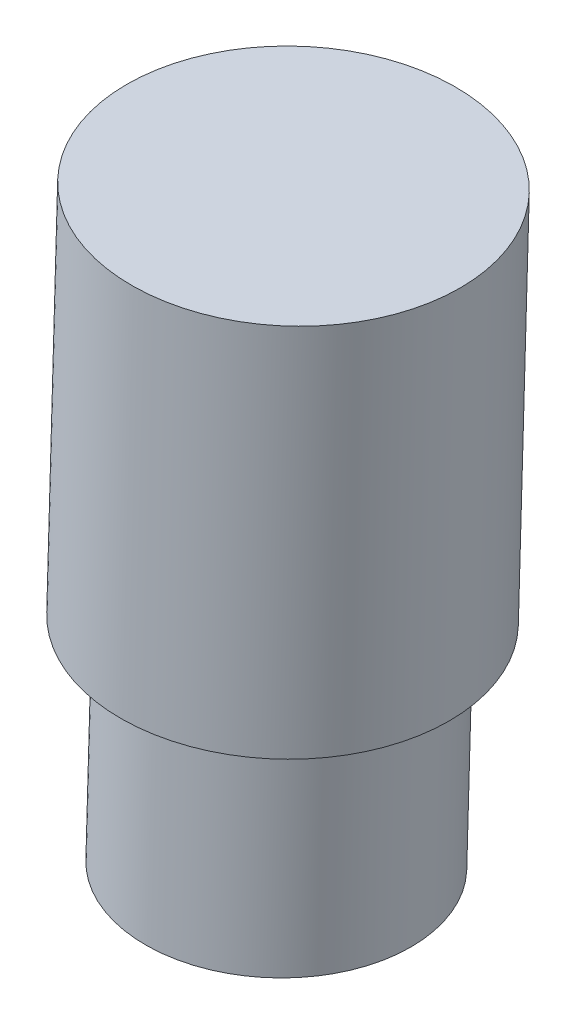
from build123d import *


with BuildPart() as part:
    # Esquisse1 → R_volution1 (revolve)
    with BuildSketch(Plane(origin=(0, 0, -182.350120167), x_dir=(-1, 0, 0), z_dir=(0, 0, -1)), mode=Mode.PRIVATE) as r_volution1_sk:
        Polygon((226.817651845, 3.589993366), (234.561745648, 3.812908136), (233.574533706, 38.10880464), (223.985821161, 37.832792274), (224.615659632, 15.952105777), (226.460278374, 16.005203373), align=None)
    revolve(r_volution1_sk.sketch.rotate(Axis((-234.568156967, 3.590177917, -182.350120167), (0.02877321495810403, 0.9995859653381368, 0)), 180), axis=Axis((-234.568156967, 3.590177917, -182.350120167), (0.02877321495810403, 0.9995859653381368, 0)))


solid = part.part
